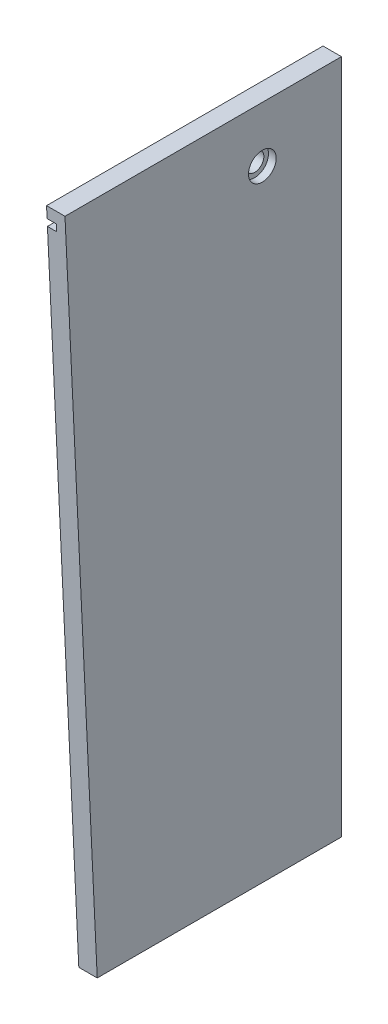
from build123d import *

# Parameters (mm, degrees)
BOSS_EXTRUDE1_DEPTH = 19.05
SKETCH2_W           = 9.525
SKETCH2_H           = 7.14375
CUT_EXTRUDE1_DEPTH  = 755.929278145
CUT_EXTRUDE2_DEPTH  = 9.525
SKETCH4_R           = 9.525
CUT_EXTRUDE3_DEPTH  = 755.929278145
SKETCH5_R           = 14.2875
CUT_EXTRUDE4_DEPTH  = 7.9375
SKETCH6_W           = 50.8
SKETCH6_H           = 686.59375
CUT_EXTRUDE5_DEPTH  = 12.7
SKETCH7_R           = 1.5875
CUT_EXTRUDE6_DEPTH  = 6.35


with BuildPart() as part:
    # Sketch1 → Boss-Extrude1 (new body)
    with BuildSketch(Plane(origin=(0, 0, 0), x_dir=(0, 0, -1), z_dir=(1, 0, 0))):
        Polygon((0, 0), (0, -698.5), (-252.4125, -698.5), (-285.75, 0), align=None)
    extrude(amount=-BOSS_EXTRUDE1_DEPTH)

    # Sketch2 → Cut-Extrude1 (cut, through all)
    with BuildSketch(Plane(origin=(0, 0, 0), x_dir=(-1, 0, 0), z_dir=(0, 0, -1))):
        with Locations((14.2875, -15.478125)):
            Rectangle(SKETCH2_W, SKETCH2_H)
    extrude(amount=-CUT_EXTRUDE1_DEPTH, mode=Mode.SUBTRACT)

    # Sketch3 → Cut-Extrude2 (cut)
    with BuildSketch(Plane.ZY.offset(19.05)):
        with BuildLine():
            Line((0, -679.45), (230.539925, -679.45))
            ThreePointArc((230.539925, -679.45), (234.1118, -683.021875), (230.539925, -686.59375))
            Line((230.539925, -686.59375), (0, -686.59375))
            Line((0, -686.59375), (0, -679.45))
        make_face()
    extrude(amount=-CUT_EXTRUDE2_DEPTH, mode=Mode.SUBTRACT)

    # Sketch4 → Cut-Extrude3 (cut, through all)
    with BuildSketch(Plane(origin=(0, 0, 0), x_dir=(0, 0, -1), z_dir=(1, 0, 0))):
        with Locations((-81.7561738, -57.15)):
            Circle(SKETCH4_R)
    extrude(amount=-CUT_EXTRUDE3_DEPTH, mode=Mode.SUBTRACT)

    # Sketch5 → Cut-Extrude4 (cut)
    with BuildSketch(Plane(origin=(0, 0, 0), x_dir=(0, 0, -1), z_dir=(1, 0, 0))):
        with Locations((-81.7561738, -57.15)):
            Circle(SKETCH5_R)
    extrude(amount=-CUT_EXTRUDE4_DEPTH, mode=Mode.SUBTRACT)

    # Sketch6 → Cut-Extrude5 (cut)
    with BuildSketch(Plane(origin=(0, 0, 0), x_dir=(-1, 0, 0), z_dir=(0, 0, -1))):
        with Locations((34.925, -355.203125)):
            Rectangle(SKETCH6_W, SKETCH6_H)
    extrude(amount=-CUT_EXTRUDE5_DEPTH, mode=Mode.SUBTRACT)

    # Sketch7 → Cut-Extrude6 (cut)
    with BuildSketch(Plane.ZY.offset(19.05)):
        with Locations((60.325, -236.5375)):
            Circle(SKETCH7_R)
        with Locations((136.525, -236.5375)):
            Circle(SKETCH7_R)
        with Locations((166.6875, -236.5375)):
            Circle(SKETCH7_R)
        with Locations((166.6875, -528.6375)):
            Circle(SKETCH7_R)
        with Locations((136.525, -528.6375)):
            Circle(SKETCH7_R)
        with Locations((60.325, -528.6375)):
            Circle(SKETCH7_R)
    extrude(amount=-CUT_EXTRUDE6_DEPTH, mode=Mode.SUBTRACT)


solid = part.part
